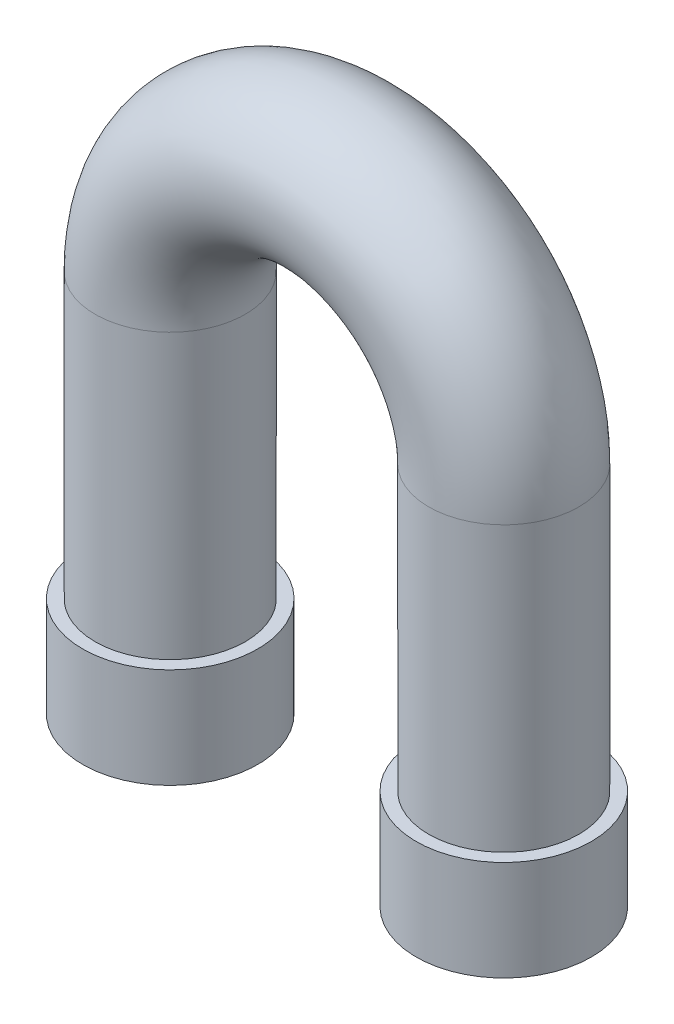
ISO-10303-21;
HEADER;
FILE_DESCRIPTION(('STEP AP214'),'2;1');
FILE_NAME('part.step','',(''),(''),'','','');
FILE_SCHEMA(('AUTOMOTIVE_DESIGN { 1 0 10303 214 1 1 1 1 }'));
ENDSEC;
DATA;
#1=APPLICATION_CONTEXT('core data for automotive mechanical design processes');
#2=APPLICATION_PROTOCOL_DEFINITION('international standard','automotive_design',2000,#1);
#3=PRODUCT_CONTEXT('',#1,'mechanical');
#4=PRODUCT('Part','Part','',(#3));
#5=PRODUCT_RELATED_PRODUCT_CATEGORY('part','',(#4));
#6=PRODUCT_DEFINITION_FORMATION('','',#4);
#7=PRODUCT_DEFINITION_CONTEXT('part definition',#1,'design');
#8=PRODUCT_DEFINITION('design','',#6,#7);
#9=PRODUCT_DEFINITION_SHAPE('','',#8);
#10=(LENGTH_UNIT() NAMED_UNIT(*) SI_UNIT(.MILLI.,.METRE.));
#11=(NAMED_UNIT(*) PLANE_ANGLE_UNIT() SI_UNIT($,.RADIAN.));
#12=(NAMED_UNIT(*) SI_UNIT($,.STERADIAN.) SOLID_ANGLE_UNIT());
#13=UNCERTAINTY_MEASURE_WITH_UNIT(LENGTH_MEASURE(1.E-05),#10,'distance_accuracy_value','');
#14=(GEOMETRIC_REPRESENTATION_CONTEXT(3) GLOBAL_UNCERTAINTY_ASSIGNED_CONTEXT((#13)) GLOBAL_UNIT_ASSIGNED_CONTEXT((#10,
#11,#12)) REPRESENTATION_CONTEXT('',''));
#15=CARTESIAN_POINT('',(0.,0.,0.));
#16=DIRECTION('',(0.,0.,1.));
#17=DIRECTION('',(1.,0.,0.));
#18=AXIS2_PLACEMENT_3D('',#15,#16,#17);
#19=CARTESIAN_POINT('',(-100.,-170.,0.));
#20=DIRECTION('',(0.,1.,0.));
#21=DIRECTION('',(-1.,0.,0.));
#22=AXIS2_PLACEMENT_3D('',#19,#20,#21);
#23=CYLINDRICAL_SURFACE('',#22,45.);
#24=CARTESIAN_POINT('',(-100.,0.,0.));
#25=DIRECTION('',(0.,-1.,0.));
#26=DIRECTION('',(1.,0.,0.));
#27=AXIS2_PLACEMENT_3D('',#24,#25,#26);
#28=CIRCLE('',#27,45.);
#29=CARTESIAN_POINT('',(-145.,0.,0.));
#30=VERTEX_POINT('',#29);
#31=EDGE_CURVE('E64',#30,#30,#28,.T.);
#32=ORIENTED_EDGE('',*,*,#31,.T.);
#33=EDGE_LOOP('',(#32));
#34=FACE_BOUND('',#33,.T.);
#35=CARTESIAN_POINT('',(-100.,-170.,0.));
#36=DIRECTION('',(0.,-1.,0.));
#37=DIRECTION('',(1.,0.,0.));
#38=AXIS2_PLACEMENT_3D('',#35,#36,#37);
#39=CIRCLE('',#38,45.);
#40=CARTESIAN_POINT('',(-55.,-170.,0.));
#41=VERTEX_POINT('',#40);
#42=EDGE_CURVE('E69',#41,#41,#39,.T.);
#43=ORIENTED_EDGE('',*,*,#42,.F.);
#44=EDGE_LOOP('',(#43));
#45=FACE_BOUND('',#44,.T.);
#46=ADVANCED_FACE('F55',(#34,#45),#23,.T.);
#47=CARTESIAN_POINT('',(0.,0.,0.));
#48=DIRECTION('',(0.,0.,-1.));
#49=DIRECTION('',(-1.,0.,0.));
#50=AXIS2_PLACEMENT_3D('',#47,#48,#49);
#51=TOROIDAL_SURFACE('',#50,100.,45.);
#52=CARTESIAN_POINT('',(100.,0.,0.));
#53=DIRECTION('',(0.,1.,0.));
#54=DIRECTION('',(-1.,0.,0.));
#55=AXIS2_PLACEMENT_3D('',#52,#53,#54);
#56=CIRCLE('',#55,45.);
#57=CARTESIAN_POINT('',(145.,0.,0.));
#58=VERTEX_POINT('',#57);
#59=EDGE_CURVE('E11',#58,#58,#56,.T.);
#60=CARTESIAN_POINT('',(0.,0.,0.));
#61=DIRECTION('',(0.,0.,-1.));
#62=DIRECTION('',(-1.,0.,0.));
#63=AXIS2_PLACEMENT_3D('',#60,#61,#62);
#64=CIRCLE('',#63,145.);
#65=EDGE_CURVE('',#30,#58,#64,.T.);
#66=ORIENTED_EDGE('',*,*,#31,.F.);
#67=ORIENTED_EDGE('',*,*,#59,.T.);
#68=ORIENTED_EDGE('',*,*,#65,.T.);
#69=ORIENTED_EDGE('',*,*,#65,.F.);
#70=EDGE_LOOP('',(#66,#68,#67,#69));
#71=FACE_BOUND('',#70,.T.);
#72=ADVANCED_FACE('F126',(#71),#51,.T.);
#73=CARTESIAN_POINT('',(100.,0.,0.));
#74=DIRECTION('',(0.,-1.,0.));
#75=DIRECTION('',(1.,0.,0.));
#76=AXIS2_PLACEMENT_3D('',#73,#74,#75);
#77=CYLINDRICAL_SURFACE('',#76,45.);
#78=CARTESIAN_POINT('',(100.,-170.,0.));
#79=DIRECTION('',(0.,1.,0.));
#80=DIRECTION('',(-1.,0.,0.));
#81=AXIS2_PLACEMENT_3D('',#78,#79,#80);
#82=CIRCLE('',#81,45.);
#83=CARTESIAN_POINT('',(55.,-170.,0.));
#84=VERTEX_POINT('',#83);
#85=EDGE_CURVE('E59',#84,#84,#82,.T.);
#86=ORIENTED_EDGE('',*,*,#85,.T.);
#87=EDGE_LOOP('',(#86));
#88=FACE_BOUND('',#87,.T.);
#89=ORIENTED_EDGE('',*,*,#59,.F.);
#90=EDGE_LOOP('',(#89));
#91=FACE_BOUND('',#90,.T.);
#92=ADVANCED_FACE('F57',(#88,#91),#77,.T.);
#93=CARTESIAN_POINT('',(-100.,-170.,0.));
#94=DIRECTION('',(0.,1.,0.));
#95=DIRECTION('',(-1.,0.,0.));
#96=AXIS2_PLACEMENT_3D('',#93,#94,#95);
#97=CYLINDRICAL_SURFACE('',#96,35.);
#98=CARTESIAN_POINT('',(-100.,0.,0.));
#99=DIRECTION('',(0.,1.,0.));
#100=DIRECTION('',(-1.,0.,0.));
#101=AXIS2_PLACEMENT_3D('',#98,#99,#100);
#102=CIRCLE('',#101,35.);
#103=CARTESIAN_POINT('',(-135.,0.,0.));
#104=VERTEX_POINT('',#103);
#105=EDGE_CURVE('E79',#104,#104,#102,.F.);
#106=ORIENTED_EDGE('',*,*,#105,.F.);
#107=EDGE_LOOP('',(#106));
#108=FACE_BOUND('',#107,.T.);
#109=CARTESIAN_POINT('',(-100.,-230.,0.));
#110=DIRECTION('',(0.,1.,0.));
#111=DIRECTION('',(-1.,0.,0.));
#112=AXIS2_PLACEMENT_3D('',#109,#110,#111);
#113=CIRCLE('',#112,35.);
#114=CARTESIAN_POINT('',(-135.,-230.,0.));
#115=VERTEX_POINT('',#114);
#116=EDGE_CURVE('E100',#115,#115,#113,.T.);
#117=ORIENTED_EDGE('',*,*,#116,.F.);
#118=EDGE_LOOP('',(#117));
#119=FACE_BOUND('',#118,.T.);
#120=ADVANCED_FACE('F111',(#108,#119),#97,.F.);
#121=CARTESIAN_POINT('',(0.,0.,0.));
#122=DIRECTION('',(0.,0.,-1.));
#123=DIRECTION('',(-1.,0.,0.));
#124=AXIS2_PLACEMENT_3D('',#121,#122,#123);
#125=TOROIDAL_SURFACE('',#124,100.,35.);
#126=CARTESIAN_POINT('',(100.,0.,0.));
#127=DIRECTION('',(0.,1.,0.));
#128=DIRECTION('',(-1.,0.,0.));
#129=AXIS2_PLACEMENT_3D('',#126,#127,#128);
#130=CIRCLE('',#129,35.);
#131=CARTESIAN_POINT('',(135.,0.,0.));
#132=VERTEX_POINT('',#131);
#133=EDGE_CURVE('E75',#132,#132,#130,.T.);
#134=CARTESIAN_POINT('',(0.,0.,0.));
#135=DIRECTION('',(0.,0.,-1.));
#136=DIRECTION('',(-1.,0.,0.));
#137=AXIS2_PLACEMENT_3D('',#134,#135,#136);
#138=CIRCLE('',#137,135.);
#139=EDGE_CURVE('',#104,#132,#138,.T.);
#140=ORIENTED_EDGE('',*,*,#105,.T.);
#141=ORIENTED_EDGE('',*,*,#133,.F.);
#142=ORIENTED_EDGE('',*,*,#139,.T.);
#143=ORIENTED_EDGE('',*,*,#139,.F.);
#144=EDGE_LOOP('',(#140,#142,#141,#143));
#145=FACE_BOUND('',#144,.T.);
#146=ADVANCED_FACE('F113',(#145),#125,.F.);
#147=CARTESIAN_POINT('',(100.,0.,0.));
#148=DIRECTION('',(0.,-1.,0.));
#149=DIRECTION('',(1.,0.,0.));
#150=AXIS2_PLACEMENT_3D('',#147,#148,#149);
#151=CYLINDRICAL_SURFACE('',#150,35.);
#152=ORIENTED_EDGE('',*,*,#133,.T.);
#153=EDGE_LOOP('',(#152));
#154=FACE_BOUND('',#153,.T.);
#155=CARTESIAN_POINT('',(100.,-230.,0.));
#156=DIRECTION('',(0.,-1.,0.));
#157=DIRECTION('',(1.,0.,0.));
#158=AXIS2_PLACEMENT_3D('',#155,#156,#157);
#159=CIRCLE('',#158,35.);
#160=CARTESIAN_POINT('',(135.,-230.,0.));
#161=VERTEX_POINT('',#160);
#162=EDGE_CURVE('E88',#161,#161,#159,.T.);
#163=ORIENTED_EDGE('',*,*,#162,.T.);
#164=EDGE_LOOP('',(#163));
#165=FACE_BOUND('',#164,.T.);
#166=ADVANCED_FACE('F122',(#154,#165),#151,.F.);
#167=CARTESIAN_POINT('',(100.,-230.,0.));
#168=DIRECTION('',(0.,-1.,0.));
#169=DIRECTION('',(1.,0.,0.));
#170=AXIS2_PLACEMENT_3D('',#167,#168,#169);
#171=PLANE('',#170);
#172=CARTESIAN_POINT('',(100.,-230.,0.));
#173=DIRECTION('',(0.,-1.,0.));
#174=DIRECTION('',(1.,0.,0.));
#175=AXIS2_PLACEMENT_3D('',#172,#173,#174);
#176=CIRCLE('',#175,52.5);
#177=CARTESIAN_POINT('',(152.5,-230.,0.));
#178=VERTEX_POINT('',#177);
#179=EDGE_CURVE('E87',#178,#178,#176,.T.);
#180=ORIENTED_EDGE('',*,*,#179,.T.);
#181=EDGE_LOOP('',(#180));
#182=FACE_BOUND('',#181,.T.);
#183=ORIENTED_EDGE('',*,*,#162,.F.);
#184=EDGE_LOOP('',(#183));
#185=FACE_BOUND('',#184,.T.);
#186=ADVANCED_FACE('F116',(#182,#185),#171,.T.);
#187=CARTESIAN_POINT('',(100.,-170.,0.));
#188=DIRECTION('',(0.,-1.,0.));
#189=DIRECTION('',(1.,0.,0.));
#190=AXIS2_PLACEMENT_3D('',#187,#188,#189);
#191=PLANE('',#190);
#192=ORIENTED_EDGE('',*,*,#85,.F.);
#193=EDGE_LOOP('',(#192));
#194=FACE_BOUND('',#193,.T.);
#195=CARTESIAN_POINT('',(100.,-170.,0.));
#196=DIRECTION('',(0.,-1.,0.));
#197=DIRECTION('',(1.,0.,0.));
#198=AXIS2_PLACEMENT_3D('',#195,#196,#197);
#199=CIRCLE('',#198,52.5);
#200=CARTESIAN_POINT('',(152.5,-170.,0.));
#201=VERTEX_POINT('',#200);
#202=EDGE_CURVE('E83',#201,#201,#199,.T.);
#203=ORIENTED_EDGE('',*,*,#202,.F.);
#204=EDGE_LOOP('',(#203));
#205=FACE_BOUND('',#204,.T.);
#206=ADVANCED_FACE('F131',(#194,#205),#191,.F.);
#207=CARTESIAN_POINT('',(100.,-230.,0.));
#208=DIRECTION('',(0.,1.,0.));
#209=DIRECTION('',(-1.,0.,0.));
#210=AXIS2_PLACEMENT_3D('',#207,#208,#209);
#211=CYLINDRICAL_SURFACE('',#210,52.5);
#212=ORIENTED_EDGE('',*,*,#179,.F.);
#213=EDGE_LOOP('',(#212));
#214=FACE_BOUND('',#213,.T.);
#215=ORIENTED_EDGE('',*,*,#202,.T.);
#216=EDGE_LOOP('',(#215));
#217=FACE_BOUND('',#216,.T.);
#218=ADVANCED_FACE('F138',(#214,#217),#211,.T.);
#219=CARTESIAN_POINT('',(-100.,-230.,0.));
#220=DIRECTION('',(0.,1.,0.));
#221=DIRECTION('',(-1.,0.,0.));
#222=AXIS2_PLACEMENT_3D('',#219,#220,#221);
#223=CYLINDRICAL_SURFACE('',#222,52.5);
#224=CARTESIAN_POINT('',(-100.,-230.,0.));
#225=DIRECTION('',(0.,1.,0.));
#226=DIRECTION('',(-1.,0.,0.));
#227=AXIS2_PLACEMENT_3D('',#224,#225,#226);
#228=CIRCLE('',#227,52.5);
#229=CARTESIAN_POINT('',(-152.5,-230.,0.));
#230=VERTEX_POINT('',#229);
#231=EDGE_CURVE('E95',#230,#230,#228,.T.);
#232=ORIENTED_EDGE('',*,*,#231,.T.);
#233=EDGE_LOOP('',(#232));
#234=FACE_BOUND('',#233,.T.);
#235=CARTESIAN_POINT('',(-100.,-170.,0.));
#236=DIRECTION('',(0.,1.,0.));
#237=DIRECTION('',(-1.,0.,0.));
#238=AXIS2_PLACEMENT_3D('',#235,#236,#237);
#239=CIRCLE('',#238,52.5);
#240=CARTESIAN_POINT('',(-152.5,-170.,0.));
#241=VERTEX_POINT('',#240);
#242=EDGE_CURVE('E96',#241,#241,#239,.T.);
#243=ORIENTED_EDGE('',*,*,#242,.F.);
#244=EDGE_LOOP('',(#243));
#245=FACE_BOUND('',#244,.T.);
#246=ADVANCED_FACE('F145',(#234,#245),#223,.T.);
#247=CARTESIAN_POINT('',(-100.,-230.,0.));
#248=DIRECTION('',(0.,-1.,0.));
#249=DIRECTION('',(-1.,0.,0.));
#250=AXIS2_PLACEMENT_3D('',#247,#248,#249);
#251=PLANE('',#250);
#252=ORIENTED_EDGE('',*,*,#116,.T.);
#253=EDGE_LOOP('',(#252));
#254=FACE_BOUND('',#253,.T.);
#255=ORIENTED_EDGE('',*,*,#231,.F.);
#256=EDGE_LOOP('',(#255));
#257=FACE_BOUND('',#256,.T.);
#258=ADVANCED_FACE('F108',(#254,#257),#251,.T.);
#259=CARTESIAN_POINT('',(-100.,-170.,0.));
#260=DIRECTION('',(0.,-1.,0.));
#261=DIRECTION('',(-1.,0.,0.));
#262=AXIS2_PLACEMENT_3D('',#259,#260,#261);
#263=PLANE('',#262);
#264=ORIENTED_EDGE('',*,*,#42,.T.);
#265=EDGE_LOOP('',(#264));
#266=FACE_BOUND('',#265,.T.);
#267=ORIENTED_EDGE('',*,*,#242,.T.);
#268=EDGE_LOOP('',(#267));
#269=FACE_BOUND('',#268,.T.);
#270=ADVANCED_FACE('F158',(#266,#269),#263,.F.);
#271=CLOSED_SHELL('',(#46,#72,#92,#120,#146,#166,#186,#206,#218,#246,#258,#270));
#272=MANIFOLD_SOLID_BREP('B2',#271);
#273=ADVANCED_BREP_SHAPE_REPRESENTATION('',(#18,#272),#14);
#274=SHAPE_DEFINITION_REPRESENTATION(#9,#273);
ENDSEC;
END-ISO-10303-21;
